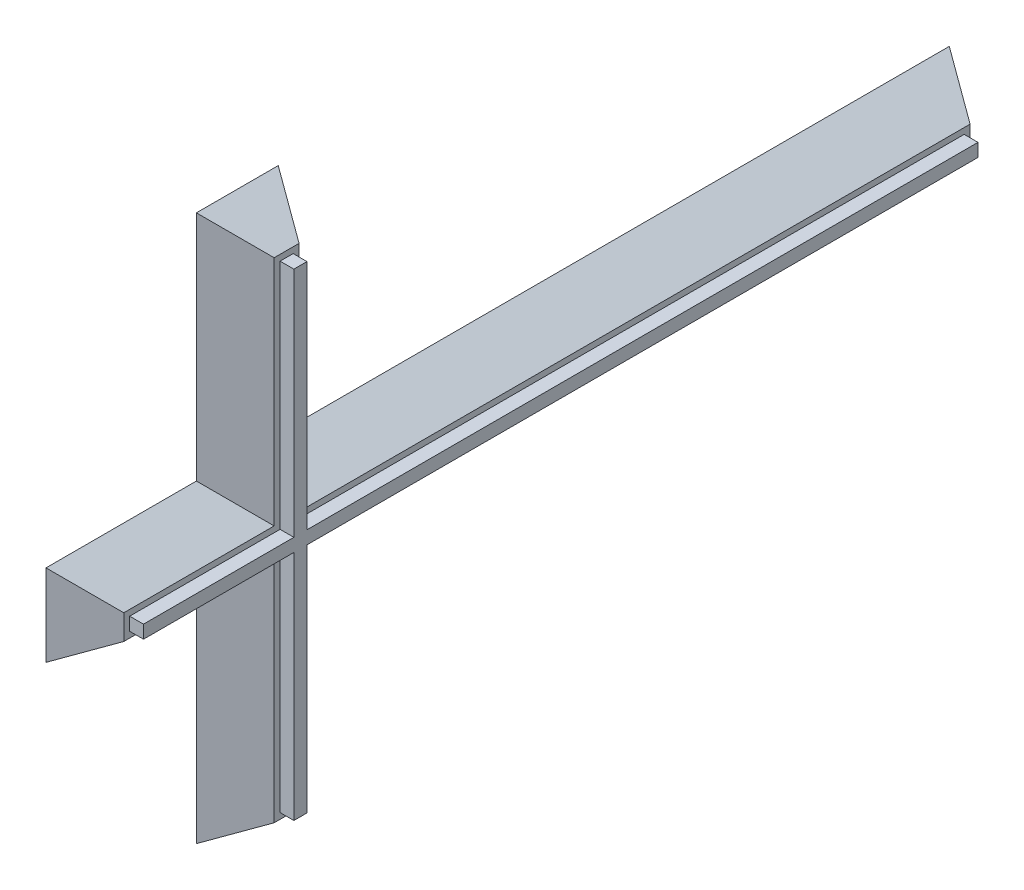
ISO-10303-21;
HEADER;
FILE_DESCRIPTION(('STEP AP214'),'2;1');
FILE_NAME('part.step','',(''),(''),'','','');
FILE_SCHEMA(('AUTOMOTIVE_DESIGN { 1 0 10303 214 1 1 1 1 }'));
ENDSEC;
DATA;
#1=APPLICATION_CONTEXT('core data for automotive mechanical design processes');
#2=APPLICATION_PROTOCOL_DEFINITION('international standard','automotive_design',2000,#1);
#3=PRODUCT_CONTEXT('',#1,'mechanical');
#4=PRODUCT('Part','Part','',(#3));
#5=PRODUCT_RELATED_PRODUCT_CATEGORY('part','',(#4));
#6=PRODUCT_DEFINITION_FORMATION('','',#4);
#7=PRODUCT_DEFINITION_CONTEXT('part definition',#1,'design');
#8=PRODUCT_DEFINITION('design','',#6,#7);
#9=PRODUCT_DEFINITION_SHAPE('','',#8);
#10=(LENGTH_UNIT() NAMED_UNIT(*) SI_UNIT(.MILLI.,.METRE.));
#11=(NAMED_UNIT(*) PLANE_ANGLE_UNIT() SI_UNIT($,.RADIAN.));
#12=(NAMED_UNIT(*) SI_UNIT($,.STERADIAN.) SOLID_ANGLE_UNIT());
#13=UNCERTAINTY_MEASURE_WITH_UNIT(LENGTH_MEASURE(1.E-05),#10,'distance_accuracy_value','');
#14=(GEOMETRIC_REPRESENTATION_CONTEXT(3) GLOBAL_UNCERTAINTY_ASSIGNED_CONTEXT((#13)) GLOBAL_UNIT_ASSIGNED_CONTEXT((#10,
#11,#12)) REPRESENTATION_CONTEXT('',''));
#15=CARTESIAN_POINT('',(0.,0.,0.));
#16=DIRECTION('',(0.,0.,1.));
#17=DIRECTION('',(1.,0.,0.));
#18=AXIS2_PLACEMENT_3D('',#15,#16,#17);
#19=CARTESIAN_POINT('',(25.,0.,0.));
#20=DIRECTION('',(-1.,0.,0.));
#21=DIRECTION('',(0.,0.,1.));
#22=AXIS2_PLACEMENT_3D('',#19,#20,#21);
#23=PLANE('',#22);
#24=DIRECTION('',(0.,-1.,0.));
#25=VECTOR('',#24,1.);
#26=CARTESIAN_POINT('',(25.,0.,-6.31624327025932));
#27=LINE('',#26,#25);
#28=CARTESIAN_POINT('',(25.,-6.31624327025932,-6.31624327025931));
#29=VERTEX_POINT('',#28);
#30=CARTESIAN_POINT('',(25.,-124.041243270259,-6.31624327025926));
#31=VERTEX_POINT('',#30);
#32=EDGE_CURVE('E284',#29,#31,#27,.T.);
#33=ORIENTED_EDGE('',*,*,#32,.F.);
#34=DIRECTION('',(0.,0.,1.));
#35=VECTOR('',#34,1.);
#36=CARTESIAN_POINT('',(25.,-6.31624327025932,0.));
#37=LINE('',#36,#35);
#38=CARTESIAN_POINT('',(25.,-6.31624327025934,-346.566243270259));
#39=VERTEX_POINT('',#38);
#40=EDGE_CURVE('E292',#39,#29,#37,.T.);
#41=ORIENTED_EDGE('',*,*,#40,.F.);
#42=DIRECTION('',(0.,-1.,0.));
#43=VECTOR('',#42,1.);
#44=CARTESIAN_POINT('',(25.,0.,-346.566243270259));
#45=LINE('',#44,#43);
#46=CARTESIAN_POINT('',(25.,6.31624327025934,-346.566243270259));
#47=VERTEX_POINT('',#46);
#48=EDGE_CURVE('E326',#47,#39,#45,.T.);
#49=ORIENTED_EDGE('',*,*,#48,.F.);
#50=DIRECTION('',(0.,0.,-1.));
#51=VECTOR('',#50,1.);
#52=CARTESIAN_POINT('',(25.,6.31624327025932,0.));
#53=LINE('',#52,#51);
#54=CARTESIAN_POINT('',(25.,6.31624327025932,-6.3162432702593));
#55=VERTEX_POINT('',#54);
#56=EDGE_CURVE('E329',#55,#47,#53,.T.);
#57=ORIENTED_EDGE('',*,*,#56,.F.);
#58=DIRECTION('',(0.,-1.,0.));
#59=VECTOR('',#58,1.);
#60=CARTESIAN_POINT('',(25.,0.,-6.3162432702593));
#61=LINE('',#60,#59);
#62=CARTESIAN_POINT('',(25.,124.091243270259,-6.31624327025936));
#63=VERTEX_POINT('',#62);
#64=EDGE_CURVE('E331',#63,#55,#61,.T.);
#65=ORIENTED_EDGE('',*,*,#64,.F.);
#66=DIRECTION('',(0.,0.,-1.));
#67=VECTOR('',#66,1.);
#68=CARTESIAN_POINT('',(25.,124.091243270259,0.));
#69=LINE('',#68,#67);
#70=CARTESIAN_POINT('',(25.,124.091243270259,6.31624327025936));
#71=VERTEX_POINT('',#70);
#72=EDGE_CURVE('E337',#71,#63,#69,.T.);
#73=ORIENTED_EDGE('',*,*,#72,.F.);
#74=DIRECTION('',(0.,1.,0.));
#75=VECTOR('',#74,1.);
#76=CARTESIAN_POINT('',(25.,0.,6.3162432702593));
#77=LINE('',#76,#75);
#78=CARTESIAN_POINT('',(25.,6.31624327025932,6.3162432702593));
#79=VERTEX_POINT('',#78);
#80=EDGE_CURVE('E345',#79,#71,#77,.T.);
#81=ORIENTED_EDGE('',*,*,#80,.F.);
#82=DIRECTION('',(0.,0.,-1.));
#83=VECTOR('',#82,1.);
#84=CARTESIAN_POINT('',(25.,6.31624327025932,0.));
#85=LINE('',#84,#83);
#86=CARTESIAN_POINT('',(25.,6.31624327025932,82.5662432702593));
#87=VERTEX_POINT('',#86);
#88=EDGE_CURVE('E347',#87,#79,#85,.T.);
#89=ORIENTED_EDGE('',*,*,#88,.F.);
#90=DIRECTION('',(0.,1.,0.));
#91=VECTOR('',#90,1.);
#92=CARTESIAN_POINT('',(25.,0.,82.5662432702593));
#93=LINE('',#92,#91);
#94=CARTESIAN_POINT('',(25.,-6.31624327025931,82.5662432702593));
#95=VERTEX_POINT('',#94);
#96=EDGE_CURVE('E348',#95,#87,#93,.T.);
#97=ORIENTED_EDGE('',*,*,#96,.F.);
#98=DIRECTION('',(0.,0.,1.));
#99=VECTOR('',#98,1.);
#100=CARTESIAN_POINT('',(25.,-6.31624327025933,0.));
#101=LINE('',#100,#99);
#102=CARTESIAN_POINT('',(25.,-6.31624327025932,6.3162432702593));
#103=VERTEX_POINT('',#102);
#104=EDGE_CURVE('E353',#103,#95,#101,.T.);
#105=ORIENTED_EDGE('',*,*,#104,.F.);
#106=DIRECTION('',(0.,1.,0.));
#107=VECTOR('',#106,1.);
#108=CARTESIAN_POINT('',(25.,0.,6.3162432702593));
#109=LINE('',#108,#107);
#110=CARTESIAN_POINT('',(25.,-124.041243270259,6.31624327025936));
#111=VERTEX_POINT('',#110);
#112=EDGE_CURVE('E360',#111,#103,#109,.T.);
#113=ORIENTED_EDGE('',*,*,#112,.F.);
#114=DIRECTION('',(0.,0.,1.));
#115=VECTOR('',#114,1.);
#116=CARTESIAN_POINT('',(25.,-124.041243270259,0.));
#117=LINE('',#116,#115);
#118=EDGE_CURVE('E47',#31,#111,#117,.T.);
#119=ORIENTED_EDGE('',*,*,#118,.F.);
#120=EDGE_LOOP('',(#33,#41,#49,#57,#65,#73,#81,#89,#97,#105,#113,#119));
#121=FACE_BOUND('',#120,.T.);
#122=DIRECTION('',(0.,0.,-1.));
#123=VECTOR('',#122,1.);
#124=CARTESIAN_POINT('',(25.,-121.041243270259,3.31624327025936));
#125=LINE('',#124,#123);
#126=CARTESIAN_POINT('',(25.,-121.041243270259,3.31624327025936));
#127=VERTEX_POINT('',#126);
#128=CARTESIAN_POINT('',(25.,-121.041243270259,-3.31624327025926));
#129=VERTEX_POINT('',#128);
#130=EDGE_CURVE('E62',#127,#129,#125,.T.);
#131=ORIENTED_EDGE('',*,*,#130,.F.);
#132=DIRECTION('',(0.,-1.,0.));
#133=VECTOR('',#132,1.);
#134=CARTESIAN_POINT('',(25.,-3.31624327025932,3.3162432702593));
#135=LINE('',#134,#133);
#136=CARTESIAN_POINT('',(25.,-3.31624327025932,3.3162432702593));
#137=VERTEX_POINT('',#136);
#138=EDGE_CURVE('E70',#137,#127,#135,.T.);
#139=ORIENTED_EDGE('',*,*,#138,.F.);
#140=DIRECTION('',(0.,0.,-1.));
#141=VECTOR('',#140,1.);
#142=CARTESIAN_POINT('',(25.,-3.31624327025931,79.5662432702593));
#143=LINE('',#142,#141);
#144=CARTESIAN_POINT('',(25.,-3.31624327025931,79.5662432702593));
#145=VERTEX_POINT('',#144);
#146=EDGE_CURVE('E623',#145,#137,#143,.T.);
#147=ORIENTED_EDGE('',*,*,#146,.F.);
#148=DIRECTION('',(0.,-1.,0.));
#149=VECTOR('',#148,1.);
#150=CARTESIAN_POINT('',(25.,3.31624327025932,79.5662432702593));
#151=LINE('',#150,#149);
#152=CARTESIAN_POINT('',(25.,3.31624327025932,79.5662432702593));
#153=VERTEX_POINT('',#152);
#154=EDGE_CURVE('E704',#153,#145,#151,.T.);
#155=ORIENTED_EDGE('',*,*,#154,.F.);
#156=DIRECTION('',(0.,0.,1.));
#157=VECTOR('',#156,1.);
#158=CARTESIAN_POINT('',(25.,3.31624327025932,3.3162432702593));
#159=LINE('',#158,#157);
#160=CARTESIAN_POINT('',(25.,3.31624327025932,3.3162432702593));
#161=VERTEX_POINT('',#160);
#162=EDGE_CURVE('E701',#161,#153,#159,.T.);
#163=ORIENTED_EDGE('',*,*,#162,.F.);
#164=DIRECTION('',(0.,-1.,0.));
#165=VECTOR('',#164,1.);
#166=CARTESIAN_POINT('',(25.,121.091243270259,3.31624327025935));
#167=LINE('',#166,#165);
#168=CARTESIAN_POINT('',(25.,121.091243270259,3.31624327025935));
#169=VERTEX_POINT('',#168);
#170=EDGE_CURVE('E700',#169,#161,#167,.T.);
#171=ORIENTED_EDGE('',*,*,#170,.F.);
#172=DIRECTION('',(0.,0.,1.));
#173=VECTOR('',#172,1.);
#174=CARTESIAN_POINT('',(25.,121.091243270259,-3.31624327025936));
#175=LINE('',#174,#173);
#176=CARTESIAN_POINT('',(25.,121.091243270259,-3.31624327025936));
#177=VERTEX_POINT('',#176);
#178=EDGE_CURVE('E691',#177,#169,#175,.T.);
#179=ORIENTED_EDGE('',*,*,#178,.F.);
#180=DIRECTION('',(0.,1.,0.));
#181=VECTOR('',#180,1.);
#182=CARTESIAN_POINT('',(25.,3.31624327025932,-3.3162432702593));
#183=LINE('',#182,#181);
#184=CARTESIAN_POINT('',(25.,3.31624327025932,-3.3162432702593));
#185=VERTEX_POINT('',#184);
#186=EDGE_CURVE('E689',#185,#177,#183,.T.);
#187=ORIENTED_EDGE('',*,*,#186,.F.);
#188=DIRECTION('',(0.,0.,1.));
#189=VECTOR('',#188,1.);
#190=CARTESIAN_POINT('',(25.,3.31624327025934,-343.566243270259));
#191=LINE('',#190,#189);
#192=CARTESIAN_POINT('',(25.,3.31624327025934,-343.566243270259));
#193=VERTEX_POINT('',#192);
#194=EDGE_CURVE('E681',#193,#185,#191,.T.);
#195=ORIENTED_EDGE('',*,*,#194,.F.);
#196=DIRECTION('',(0.,1.,0.));
#197=VECTOR('',#196,1.);
#198=CARTESIAN_POINT('',(25.,-3.31624327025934,-343.566243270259));
#199=LINE('',#198,#197);
#200=CARTESIAN_POINT('',(25.,-3.31624327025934,-343.566243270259));
#201=VERTEX_POINT('',#200);
#202=EDGE_CURVE('E673',#201,#193,#199,.T.);
#203=ORIENTED_EDGE('',*,*,#202,.F.);
#204=DIRECTION('',(0.,0.,-1.));
#205=VECTOR('',#204,1.);
#206=CARTESIAN_POINT('',(25.,-3.31624327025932,-3.31624327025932));
#207=LINE('',#206,#205);
#208=CARTESIAN_POINT('',(25.,-3.31624327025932,-3.31624327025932));
#209=VERTEX_POINT('',#208);
#210=EDGE_CURVE('E674',#209,#201,#207,.T.);
#211=ORIENTED_EDGE('',*,*,#210,.F.);
#212=DIRECTION('',(0.,1.,0.));
#213=VECTOR('',#212,1.);
#214=CARTESIAN_POINT('',(25.,-121.041243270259,-3.31624327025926));
#215=LINE('',#214,#213);
#216=EDGE_CURVE('E677',#129,#209,#215,.T.);
#217=ORIENTED_EDGE('',*,*,#216,.F.);
#218=EDGE_LOOP('',(#131,#139,#147,#155,#163,#171,#179,#187,#195,#203,#211,#217));
#219=FACE_BOUND('',#218,.T.);
#220=ADVANCED_FACE('F44',(#121,#219),#23,.F.);
#221=CARTESIAN_POINT('',(0.,-20.75,-20.75));
#222=DIRECTION('',(0.500000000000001,0.,-0.866025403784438));
#223=DIRECTION('',(0.866025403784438,0.,0.500000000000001));
#224=AXIS2_PLACEMENT_3D('',#221,#222,#223);
#225=PLANE('',#224);
#226=DIRECTION('',(0.,-1.,0.));
#227=VECTOR('',#226,1.);
#228=CARTESIAN_POINT('',(0.,-20.75,-20.75));
#229=LINE('',#228,#227);
#230=CARTESIAN_POINT('',(0.,-20.75,-20.75));
#231=VERTEX_POINT('',#230);
#232=CARTESIAN_POINT('',(0.,-138.475,-20.7499999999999));
#233=VERTEX_POINT('',#232);
#234=EDGE_CURVE('E233',#231,#233,#229,.T.);
#235=ORIENTED_EDGE('',*,*,#234,.F.);
#236=DIRECTION('',(-0.774596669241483,-0.447213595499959,-0.447213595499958));
#237=VECTOR('',#236,1.);
#238=CARTESIAN_POINT('',(0.,-20.75,-20.75));
#239=LINE('',#238,#237);
#240=EDGE_CURVE('E11',#29,#231,#239,.T.);
#241=ORIENTED_EDGE('',*,*,#240,.F.);
#242=ORIENTED_EDGE('',*,*,#32,.T.);
#243=DIRECTION('',(-0.774596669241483,-0.447213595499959,-0.447213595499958));
#244=VECTOR('',#243,1.);
#245=CARTESIAN_POINT('',(40.7811362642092,-114.93,2.7950000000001));
#246=LINE('',#245,#244);
#247=EDGE_CURVE('E290',#31,#233,#246,.T.);
#248=ORIENTED_EDGE('',*,*,#247,.T.);
#249=EDGE_LOOP('',(#235,#241,#242,#248));
#250=FACE_BOUND('',#249,.T.);
#251=ADVANCED_FACE('F380',(#250),#225,.T.);
#252=CARTESIAN_POINT('',(0.,-20.75,-361.));
#253=DIRECTION('',(0.500000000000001,-0.866025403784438,0.));
#254=DIRECTION('',(0.866025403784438,0.500000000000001,0.));
#255=AXIS2_PLACEMENT_3D('',#252,#253,#254);
#256=PLANE('',#255);
#257=DIRECTION('',(0.,0.,1.));
#258=VECTOR('',#257,1.);
#259=CARTESIAN_POINT('',(0.,-20.75,-361.));
#260=LINE('',#259,#258);
#261=CARTESIAN_POINT('',(0.,-20.75,-361.));
#262=VERTEX_POINT('',#261);
#263=EDGE_CURVE('E285',#262,#231,#260,.T.);
#264=ORIENTED_EDGE('',*,*,#263,.F.);
#265=DIRECTION('',(-0.774596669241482,-0.447213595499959,-0.447213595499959));
#266=VECTOR('',#265,1.);
#267=CARTESIAN_POINT('',(14.3760217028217,-12.45,-352.7));
#268=LINE('',#267,#266);
#269=EDGE_CURVE('E54',#39,#262,#268,.T.);
#270=ORIENTED_EDGE('',*,*,#269,.F.);
#271=ORIENTED_EDGE('',*,*,#40,.T.);
#272=ORIENTED_EDGE('',*,*,#240,.T.);
#273=EDGE_LOOP('',(#264,#270,#271,#272));
#274=FACE_BOUND('',#273,.T.);
#275=ADVANCED_FACE('F50',(#274),#256,.T.);
#276=CARTESIAN_POINT('',(0.,20.75,-361.));
#277=DIRECTION('',(0.500000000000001,0.,-0.866025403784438));
#278=DIRECTION('',(0.866025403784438,0.,0.500000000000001));
#279=AXIS2_PLACEMENT_3D('',#276,#277,#278);
#280=PLANE('',#279);
#281=DIRECTION('',(0.,-1.,0.));
#282=VECTOR('',#281,1.);
#283=CARTESIAN_POINT('',(0.,20.75,-361.));
#284=LINE('',#283,#282);
#285=CARTESIAN_POINT('',(0.,20.75,-361.));
#286=VERTEX_POINT('',#285);
#287=EDGE_CURVE('E279',#286,#262,#284,.T.);
#288=ORIENTED_EDGE('',*,*,#287,.F.);
#289=DIRECTION('',(-0.774596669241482,0.447213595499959,-0.447213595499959));
#290=VECTOR('',#289,1.);
#291=CARTESIAN_POINT('',(117.866057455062,-47.3000000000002,-292.95));
#292=LINE('',#291,#290);
#293=EDGE_CURVE('E312',#47,#286,#292,.T.);
#294=ORIENTED_EDGE('',*,*,#293,.F.);
#295=ORIENTED_EDGE('',*,*,#48,.T.);
#296=ORIENTED_EDGE('',*,*,#269,.T.);
#297=EDGE_LOOP('',(#288,#294,#295,#296));
#298=FACE_BOUND('',#297,.T.);
#299=ADVANCED_FACE('F411',(#298),#280,.T.);
#300=CARTESIAN_POINT('',(0.,20.75,-20.75));
#301=DIRECTION('',(0.500000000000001,0.866025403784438,0.));
#302=DIRECTION('',(0.866025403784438,-0.500000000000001,0.));
#303=AXIS2_PLACEMENT_3D('',#300,#301,#302);
#304=PLANE('',#303);
#305=DIRECTION('',(0.,0.,-1.));
#306=VECTOR('',#305,1.);
#307=CARTESIAN_POINT('',(0.,20.75,-20.75));
#308=LINE('',#307,#306);
#309=CARTESIAN_POINT('',(0.,20.75,-20.75));
#310=VERTEX_POINT('',#309);
#311=EDGE_CURVE('E273',#310,#286,#308,.T.);
#312=ORIENTED_EDGE('',*,*,#311,.F.);
#313=DIRECTION('',(-0.774596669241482,0.447213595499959,-0.447213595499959));
#314=VECTOR('',#313,1.);
#315=CARTESIAN_POINT('',(0.,20.75,-20.75));
#316=LINE('',#315,#314);
#317=EDGE_CURVE('E315',#55,#310,#316,.T.);
#318=ORIENTED_EDGE('',*,*,#317,.F.);
#319=ORIENTED_EDGE('',*,*,#56,.T.);
#320=ORIENTED_EDGE('',*,*,#293,.T.);
#321=EDGE_LOOP('',(#312,#318,#319,#320));
#322=FACE_BOUND('',#321,.T.);
#323=ADVANCED_FACE('F387',(#322),#304,.T.);
#324=CARTESIAN_POINT('',(0.,138.525,-20.75));
#325=DIRECTION('',(0.500000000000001,0.,-0.866025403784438));
#326=DIRECTION('',(0.866025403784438,0.,0.500000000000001));
#327=AXIS2_PLACEMENT_3D('',#324,#325,#326);
#328=PLANE('',#327);
#329=DIRECTION('',(0.,-1.,0.));
#330=VECTOR('',#329,1.);
#331=CARTESIAN_POINT('',(0.,138.525,-20.75));
#332=LINE('',#331,#330);
#333=CARTESIAN_POINT('',(0.,138.525,-20.75));
#334=VERTEX_POINT('',#333);
#335=EDGE_CURVE('E269',#334,#310,#332,.T.);
#336=ORIENTED_EDGE('',*,*,#335,.F.);
#337=DIRECTION('',(-0.774596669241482,0.447213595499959,-0.447213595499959));
#338=VECTOR('',#337,1.);
#339=CARTESIAN_POINT('',(14.3760217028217,130.225,-12.45));
#340=LINE('',#339,#338);
#341=EDGE_CURVE('E310',#63,#334,#340,.T.);
#342=ORIENTED_EDGE('',*,*,#341,.F.);
#343=ORIENTED_EDGE('',*,*,#64,.T.);
#344=ORIENTED_EDGE('',*,*,#317,.T.);
#345=EDGE_LOOP('',(#336,#342,#343,#344));
#346=FACE_BOUND('',#345,.T.);
#347=ADVANCED_FACE('F388',(#346),#328,.T.);
#348=CARTESIAN_POINT('',(0.,138.525,20.75));
#349=DIRECTION('',(0.500000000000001,0.866025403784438,0.));
#350=DIRECTION('',(0.866025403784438,-0.500000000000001,0.));
#351=AXIS2_PLACEMENT_3D('',#348,#349,#350);
#352=PLANE('',#351);
#353=DIRECTION('',(0.,0.,-1.));
#354=VECTOR('',#353,1.);
#355=CARTESIAN_POINT('',(0.,138.525,20.75));
#356=LINE('',#355,#354);
#357=CARTESIAN_POINT('',(0.,138.525,20.75));
#358=VERTEX_POINT('',#357);
#359=EDGE_CURVE('E266',#358,#334,#356,.T.);
#360=ORIENTED_EDGE('',*,*,#359,.F.);
#361=DIRECTION('',(-0.774596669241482,0.447213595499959,0.447213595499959));
#362=VECTOR('',#361,1.);
#363=CARTESIAN_POINT('',(40.798456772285,114.97,-2.80500000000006));
#364=LINE('',#363,#362);
#365=EDGE_CURVE('E308',#71,#358,#364,.T.);
#366=ORIENTED_EDGE('',*,*,#365,.F.);
#367=ORIENTED_EDGE('',*,*,#72,.T.);
#368=ORIENTED_EDGE('',*,*,#341,.T.);
#369=EDGE_LOOP('',(#360,#366,#367,#368));
#370=FACE_BOUND('',#369,.T.);
#371=ADVANCED_FACE('F394',(#370),#352,.T.);
#372=CARTESIAN_POINT('',(0.,20.75,20.75));
#373=DIRECTION('',(0.500000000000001,0.,0.866025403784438));
#374=DIRECTION('',(0.866025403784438,0.,-0.500000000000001));
#375=AXIS2_PLACEMENT_3D('',#372,#373,#374);
#376=PLANE('',#375);
#377=DIRECTION('',(0.,1.,0.));
#378=VECTOR('',#377,1.);
#379=CARTESIAN_POINT('',(0.,20.75,20.75));
#380=LINE('',#379,#378);
#381=CARTESIAN_POINT('',(0.,20.75,20.75));
#382=VERTEX_POINT('',#381);
#383=EDGE_CURVE('E265',#382,#358,#380,.T.);
#384=ORIENTED_EDGE('',*,*,#383,.F.);
#385=DIRECTION('',(-0.774596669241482,0.447213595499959,0.447213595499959));
#386=VECTOR('',#385,1.);
#387=CARTESIAN_POINT('',(0.,20.75,20.75));
#388=LINE('',#387,#386);
#389=EDGE_CURVE('E301',#79,#382,#388,.T.);
#390=ORIENTED_EDGE('',*,*,#389,.F.);
#391=ORIENTED_EDGE('',*,*,#80,.T.);
#392=ORIENTED_EDGE('',*,*,#365,.T.);
#393=EDGE_LOOP('',(#384,#390,#391,#392));
#394=FACE_BOUND('',#393,.T.);
#395=ADVANCED_FACE('F396',(#394),#376,.T.);
#396=CARTESIAN_POINT('',(0.,20.75,97.));
#397=DIRECTION('',(0.500000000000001,0.866025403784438,0.));
#398=DIRECTION('',(0.866025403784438,-0.500000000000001,0.));
#399=AXIS2_PLACEMENT_3D('',#396,#397,#398);
#400=PLANE('',#399);
#401=DIRECTION('',(0.,0.,-1.));
#402=VECTOR('',#401,1.);
#403=CARTESIAN_POINT('',(0.,20.75,97.));
#404=LINE('',#403,#402);
#405=CARTESIAN_POINT('',(0.,20.75,97.));
#406=VERTEX_POINT('',#405);
#407=EDGE_CURVE('E256',#406,#382,#404,.T.);
#408=ORIENTED_EDGE('',*,*,#407,.F.);
#409=DIRECTION('',(-0.774596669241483,0.447213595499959,0.447213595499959));
#410=VECTOR('',#409,1.);
#411=CARTESIAN_POINT('',(14.3760217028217,12.45,88.7));
#412=LINE('',#411,#410);
#413=EDGE_CURVE('E299',#87,#406,#412,.T.);
#414=ORIENTED_EDGE('',*,*,#413,.F.);
#415=ORIENTED_EDGE('',*,*,#88,.T.);
#416=ORIENTED_EDGE('',*,*,#389,.T.);
#417=EDGE_LOOP('',(#408,#414,#415,#416));
#418=FACE_BOUND('',#417,.T.);
#419=ADVANCED_FACE('F401',(#418),#400,.T.);
#420=CARTESIAN_POINT('',(0.,-20.75,97.));
#421=DIRECTION('',(0.500000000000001,0.,0.866025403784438));
#422=DIRECTION('',(0.866025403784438,0.,-0.500000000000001));
#423=AXIS2_PLACEMENT_3D('',#420,#421,#422);
#424=PLANE('',#423);
#425=DIRECTION('',(0.,1.,0.));
#426=VECTOR('',#425,1.);
#427=CARTESIAN_POINT('',(0.,-20.75,97.));
#428=LINE('',#427,#426);
#429=CARTESIAN_POINT('',(0.,-20.75,97.));
#430=VERTEX_POINT('',#429);
#431=EDGE_CURVE('E255',#430,#406,#428,.T.);
#432=ORIENTED_EDGE('',*,*,#431,.F.);
#433=DIRECTION('',(-0.774596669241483,-0.447213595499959,0.447213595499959));
#434=VECTOR('',#433,1.);
#435=CARTESIAN_POINT('',(26.4137748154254,-5.49999999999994,81.75));
#436=LINE('',#435,#434);
#437=EDGE_CURVE('E300',#95,#430,#436,.T.);
#438=ORIENTED_EDGE('',*,*,#437,.F.);
#439=ORIENTED_EDGE('',*,*,#96,.T.);
#440=ORIENTED_EDGE('',*,*,#413,.T.);
#441=EDGE_LOOP('',(#432,#438,#439,#440));
#442=FACE_BOUND('',#441,.T.);
#443=ADVANCED_FACE('F406',(#442),#424,.T.);
#444=CARTESIAN_POINT('',(0.,-20.75,20.75));
#445=DIRECTION('',(0.500000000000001,-0.866025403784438,0.));
#446=DIRECTION('',(0.866025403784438,0.500000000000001,0.));
#447=AXIS2_PLACEMENT_3D('',#444,#445,#446);
#448=PLANE('',#447);
#449=DIRECTION('',(0.,0.,1.));
#450=VECTOR('',#449,1.);
#451=CARTESIAN_POINT('',(0.,-20.75,20.75));
#452=LINE('',#451,#450);
#453=CARTESIAN_POINT('',(0.,-20.75,20.75));
#454=VERTEX_POINT('',#453);
#455=EDGE_CURVE('E247',#454,#430,#452,.T.);
#456=ORIENTED_EDGE('',*,*,#455,.F.);
#457=DIRECTION('',(-0.774596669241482,-0.447213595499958,0.447213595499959));
#458=VECTOR('',#457,1.);
#459=CARTESIAN_POINT('',(0.,-20.75,20.75));
#460=LINE('',#459,#458);
#461=EDGE_CURVE('E294',#103,#454,#460,.T.);
#462=ORIENTED_EDGE('',*,*,#461,.F.);
#463=ORIENTED_EDGE('',*,*,#104,.T.);
#464=ORIENTED_EDGE('',*,*,#437,.T.);
#465=EDGE_LOOP('',(#456,#462,#463,#464));
#466=FACE_BOUND('',#465,.T.);
#467=ADVANCED_FACE('F408',(#466),#448,.T.);
#468=CARTESIAN_POINT('',(0.,-138.475,20.75));
#469=DIRECTION('',(0.500000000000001,0.,0.866025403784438));
#470=DIRECTION('',(0.866025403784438,0.,-0.500000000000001));
#471=AXIS2_PLACEMENT_3D('',#468,#469,#470);
#472=PLANE('',#471);
#473=DIRECTION('',(0.,1.,0.));
#474=VECTOR('',#473,1.);
#475=CARTESIAN_POINT('',(0.,-138.475,20.75));
#476=LINE('',#475,#474);
#477=CARTESIAN_POINT('',(0.,-138.475,20.75));
#478=VERTEX_POINT('',#477);
#479=EDGE_CURVE('E248',#478,#454,#476,.T.);
#480=ORIENTED_EDGE('',*,*,#479,.F.);
#481=DIRECTION('',(-0.774596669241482,-0.447213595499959,0.447213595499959));
#482=VECTOR('',#481,1.);
#483=CARTESIAN_POINT('',(14.3760217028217,-130.175,12.45));
#484=LINE('',#483,#482);
#485=EDGE_CURVE('E287',#111,#478,#484,.T.);
#486=ORIENTED_EDGE('',*,*,#485,.F.);
#487=ORIENTED_EDGE('',*,*,#112,.T.);
#488=ORIENTED_EDGE('',*,*,#461,.T.);
#489=EDGE_LOOP('',(#480,#486,#487,#488));
#490=FACE_BOUND('',#489,.T.);
#491=ADVANCED_FACE('F409',(#490),#472,.T.);
#492=CARTESIAN_POINT('',(0.,-138.475,-20.7499999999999));
#493=DIRECTION('',(0.500000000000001,-0.866025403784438,0.));
#494=DIRECTION('',(0.866025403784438,0.500000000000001,0.));
#495=AXIS2_PLACEMENT_3D('',#492,#493,#494);
#496=PLANE('',#495);
#497=DIRECTION('',(0.,0.,1.));
#498=VECTOR('',#497,1.);
#499=CARTESIAN_POINT('',(0.,-138.475,-20.7499999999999));
#500=LINE('',#499,#498);
#501=EDGE_CURVE('E240',#233,#478,#500,.T.);
#502=ORIENTED_EDGE('',*,*,#501,.F.);
#503=ORIENTED_EDGE('',*,*,#247,.F.);
#504=ORIENTED_EDGE('',*,*,#118,.T.);
#505=ORIENTED_EDGE('',*,*,#485,.T.);
#506=EDGE_LOOP('',(#502,#503,#504,#505));
#507=FACE_BOUND('',#506,.T.);
#508=ADVANCED_FACE('F369',(#507),#496,.T.);
#509=CARTESIAN_POINT('',(0.,0.,0.));
#510=DIRECTION('',(-1.,0.,0.));
#511=DIRECTION('',(0.,0.,1.));
#512=AXIS2_PLACEMENT_3D('',#509,#510,#511);
#513=PLANE('',#512);
#514=ORIENTED_EDGE('',*,*,#234,.T.);
#515=ORIENTED_EDGE('',*,*,#501,.T.);
#516=ORIENTED_EDGE('',*,*,#479,.T.);
#517=ORIENTED_EDGE('',*,*,#455,.T.);
#518=ORIENTED_EDGE('',*,*,#431,.T.);
#519=ORIENTED_EDGE('',*,*,#407,.T.);
#520=ORIENTED_EDGE('',*,*,#383,.T.);
#521=ORIENTED_EDGE('',*,*,#359,.T.);
#522=ORIENTED_EDGE('',*,*,#335,.T.);
#523=ORIENTED_EDGE('',*,*,#311,.T.);
#524=ORIENTED_EDGE('',*,*,#287,.T.);
#525=ORIENTED_EDGE('',*,*,#263,.T.);
#526=EDGE_LOOP('',(#514,#515,#516,#517,#518,#519,#520,#521,#522,#523,#524,#525));
#527=FACE_BOUND('',#526,.T.);
#528=ADVANCED_FACE('F415',(#527),#513,.T.);
#529=CARTESIAN_POINT('',(32.,-121.041243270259,3.31624327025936));
#530=DIRECTION('',(0.,1.,0.));
#531=DIRECTION('',(0.,0.,1.));
#532=AXIS2_PLACEMENT_3D('',#529,#530,#531);
#533=PLANE('',#532);
#534=ORIENTED_EDGE('',*,*,#130,.T.);
#535=DIRECTION('',(-1.,0.,0.));
#536=VECTOR('',#535,1.);
#537=CARTESIAN_POINT('',(32.,-121.041243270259,-3.31624327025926));
#538=LINE('',#537,#536);
#539=CARTESIAN_POINT('',(32.,-121.041243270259,-3.31624327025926));
#540=VERTEX_POINT('',#539);
#541=EDGE_CURVE('E211',#540,#129,#538,.T.);
#542=ORIENTED_EDGE('',*,*,#541,.F.);
#543=DIRECTION('',(0.,0.,-1.));
#544=VECTOR('',#543,1.);
#545=CARTESIAN_POINT('',(32.,-121.041243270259,3.31624327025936));
#546=LINE('',#545,#544);
#547=CARTESIAN_POINT('',(32.,-121.041243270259,3.31624327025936));
#548=VERTEX_POINT('',#547);
#549=EDGE_CURVE('E217',#548,#540,#546,.T.);
#550=ORIENTED_EDGE('',*,*,#549,.F.);
#551=DIRECTION('',(-1.,0.,0.));
#552=VECTOR('',#551,1.);
#553=CARTESIAN_POINT('',(32.,-121.041243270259,3.31624327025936));
#554=LINE('',#553,#552);
#555=EDGE_CURVE('E622',#548,#127,#554,.T.);
#556=ORIENTED_EDGE('',*,*,#555,.T.);
#557=EDGE_LOOP('',(#534,#542,#550,#556));
#558=FACE_BOUND('',#557,.T.);
#559=ADVANCED_FACE('F228',(#558),#533,.F.);
#560=CARTESIAN_POINT('',(32.,-121.041243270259,-3.31624327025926));
#561=DIRECTION('',(0.,0.,1.));
#562=DIRECTION('',(0.,-1.,0.));
#563=AXIS2_PLACEMENT_3D('',#560,#561,#562);
#564=PLANE('',#563);
#565=ORIENTED_EDGE('',*,*,#216,.T.);
#566=DIRECTION('',(-1.,0.,0.));
#567=VECTOR('',#566,1.);
#568=CARTESIAN_POINT('',(32.,-3.31624327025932,-3.31624327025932));
#569=LINE('',#568,#567);
#570=CARTESIAN_POINT('',(32.,-3.31624327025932,-3.31624327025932));
#571=VERTEX_POINT('',#570);
#572=EDGE_CURVE('E213',#571,#209,#569,.T.);
#573=ORIENTED_EDGE('',*,*,#572,.F.);
#574=DIRECTION('',(0.,1.,0.));
#575=VECTOR('',#574,1.);
#576=CARTESIAN_POINT('',(32.,-121.041243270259,-3.31624327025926));
#577=LINE('',#576,#575);
#578=EDGE_CURVE('E206',#540,#571,#577,.T.);
#579=ORIENTED_EDGE('',*,*,#578,.F.);
#580=ORIENTED_EDGE('',*,*,#541,.T.);
#581=EDGE_LOOP('',(#565,#573,#579,#580));
#582=FACE_BOUND('',#581,.T.);
#583=ADVANCED_FACE('F207',(#582),#564,.F.);
#584=CARTESIAN_POINT('',(32.,-3.31624327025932,-3.31624327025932));
#585=DIRECTION('',(0.,1.,0.));
#586=DIRECTION('',(0.,0.,1.));
#587=AXIS2_PLACEMENT_3D('',#584,#585,#586);
#588=PLANE('',#587);
#589=ORIENTED_EDGE('',*,*,#210,.T.);
#590=DIRECTION('',(-1.,0.,0.));
#591=VECTOR('',#590,1.);
#592=CARTESIAN_POINT('',(32.,-3.31624327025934,-343.566243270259));
#593=LINE('',#592,#591);
#594=CARTESIAN_POINT('',(32.,-3.31624327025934,-343.566243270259));
#595=VERTEX_POINT('',#594);
#596=EDGE_CURVE('E239',#595,#201,#593,.T.);
#597=ORIENTED_EDGE('',*,*,#596,.F.);
#598=DIRECTION('',(0.,0.,-1.));
#599=VECTOR('',#598,1.);
#600=CARTESIAN_POINT('',(32.,-3.31624327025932,-3.31624327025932));
#601=LINE('',#600,#599);
#602=EDGE_CURVE('E220',#571,#595,#601,.T.);
#603=ORIENTED_EDGE('',*,*,#602,.F.);
#604=ORIENTED_EDGE('',*,*,#572,.T.);
#605=EDGE_LOOP('',(#589,#597,#603,#604));
#606=FACE_BOUND('',#605,.T.);
#607=ADVANCED_FACE('F512',(#606),#588,.F.);
#608=CARTESIAN_POINT('',(32.,-3.31624327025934,-343.566243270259));
#609=DIRECTION('',(0.,0.,1.));
#610=DIRECTION('',(1.,0.,0.));
#611=AXIS2_PLACEMENT_3D('',#608,#609,#610);
#612=PLANE('',#611);
#613=ORIENTED_EDGE('',*,*,#202,.T.);
#614=DIRECTION('',(-1.,0.,0.));
#615=VECTOR('',#614,1.);
#616=CARTESIAN_POINT('',(32.,3.31624327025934,-343.566243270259));
#617=LINE('',#616,#615);
#618=CARTESIAN_POINT('',(32.,3.31624327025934,-343.566243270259));
#619=VERTEX_POINT('',#618);
#620=EDGE_CURVE('E662',#619,#193,#617,.T.);
#621=ORIENTED_EDGE('',*,*,#620,.F.);
#622=DIRECTION('',(0.,1.,0.));
#623=VECTOR('',#622,1.);
#624=CARTESIAN_POINT('',(32.,-3.31624327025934,-343.566243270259));
#625=LINE('',#624,#623);
#626=EDGE_CURVE('E675',#595,#619,#625,.T.);
#627=ORIENTED_EDGE('',*,*,#626,.F.);
#628=ORIENTED_EDGE('',*,*,#596,.T.);
#629=EDGE_LOOP('',(#613,#621,#627,#628));
#630=FACE_BOUND('',#629,.T.);
#631=ADVANCED_FACE('F518',(#630),#612,.F.);
#632=CARTESIAN_POINT('',(32.,3.31624327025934,-343.566243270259));
#633=DIRECTION('',(0.,-1.,0.));
#634=DIRECTION('',(0.,0.,-1.));
#635=AXIS2_PLACEMENT_3D('',#632,#633,#634);
#636=PLANE('',#635);
#637=ORIENTED_EDGE('',*,*,#194,.T.);
#638=DIRECTION('',(-1.,0.,0.));
#639=VECTOR('',#638,1.);
#640=CARTESIAN_POINT('',(32.,3.31624327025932,-3.3162432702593));
#641=LINE('',#640,#639);
#642=CARTESIAN_POINT('',(32.,3.31624327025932,-3.3162432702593));
#643=VERTEX_POINT('',#642);
#644=EDGE_CURVE('E660',#643,#185,#641,.T.);
#645=ORIENTED_EDGE('',*,*,#644,.F.);
#646=DIRECTION('',(0.,0.,1.));
#647=VECTOR('',#646,1.);
#648=CARTESIAN_POINT('',(32.,3.31624327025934,-343.566243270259));
#649=LINE('',#648,#647);
#650=EDGE_CURVE('E726',#619,#643,#649,.T.);
#651=ORIENTED_EDGE('',*,*,#650,.F.);
#652=ORIENTED_EDGE('',*,*,#620,.T.);
#653=EDGE_LOOP('',(#637,#645,#651,#652));
#654=FACE_BOUND('',#653,.T.);
#655=ADVANCED_FACE('F530',(#654),#636,.F.);
#656=CARTESIAN_POINT('',(32.,3.31624327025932,-3.3162432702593));
#657=DIRECTION('',(0.,0.,1.));
#658=DIRECTION('',(0.,-1.,0.));
#659=AXIS2_PLACEMENT_3D('',#656,#657,#658);
#660=PLANE('',#659);
#661=ORIENTED_EDGE('',*,*,#186,.T.);
#662=DIRECTION('',(-1.,0.,0.));
#663=VECTOR('',#662,1.);
#664=CARTESIAN_POINT('',(32.,121.091243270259,-3.31624327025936));
#665=LINE('',#664,#663);
#666=CARTESIAN_POINT('',(32.,121.091243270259,-3.31624327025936));
#667=VERTEX_POINT('',#666);
#668=EDGE_CURVE('E653',#667,#177,#665,.T.);
#669=ORIENTED_EDGE('',*,*,#668,.F.);
#670=DIRECTION('',(0.,1.,0.));
#671=VECTOR('',#670,1.);
#672=CARTESIAN_POINT('',(32.,3.31624327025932,-3.3162432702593));
#673=LINE('',#672,#671);
#674=EDGE_CURVE('E728',#643,#667,#673,.T.);
#675=ORIENTED_EDGE('',*,*,#674,.F.);
#676=ORIENTED_EDGE('',*,*,#644,.T.);
#677=EDGE_LOOP('',(#661,#669,#675,#676));
#678=FACE_BOUND('',#677,.T.);
#679=ADVANCED_FACE('F537',(#678),#660,.F.);
#680=CARTESIAN_POINT('',(32.,121.091243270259,-3.31624327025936));
#681=DIRECTION('',(0.,-1.,0.));
#682=DIRECTION('',(0.,0.,-1.));
#683=AXIS2_PLACEMENT_3D('',#680,#681,#682);
#684=PLANE('',#683);
#685=ORIENTED_EDGE('',*,*,#178,.T.);
#686=DIRECTION('',(-1.,0.,0.));
#687=VECTOR('',#686,1.);
#688=CARTESIAN_POINT('',(32.,121.091243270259,3.31624327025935));
#689=LINE('',#688,#687);
#690=CARTESIAN_POINT('',(32.,121.091243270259,3.31624327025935));
#691=VERTEX_POINT('',#690);
#692=EDGE_CURVE('E647',#691,#169,#689,.T.);
#693=ORIENTED_EDGE('',*,*,#692,.F.);
#694=DIRECTION('',(0.,0.,1.));
#695=VECTOR('',#694,1.);
#696=CARTESIAN_POINT('',(32.,121.091243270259,-3.31624327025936));
#697=LINE('',#696,#695);
#698=EDGE_CURVE('E725',#667,#691,#697,.T.);
#699=ORIENTED_EDGE('',*,*,#698,.F.);
#700=ORIENTED_EDGE('',*,*,#668,.T.);
#701=EDGE_LOOP('',(#685,#693,#699,#700));
#702=FACE_BOUND('',#701,.T.);
#703=ADVANCED_FACE('F548',(#702),#684,.F.);
#704=CARTESIAN_POINT('',(32.,121.091243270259,3.31624327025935));
#705=DIRECTION('',(0.,0.,-1.));
#706=DIRECTION('',(0.,1.,0.));
#707=AXIS2_PLACEMENT_3D('',#704,#705,#706);
#708=PLANE('',#707);
#709=ORIENTED_EDGE('',*,*,#170,.T.);
#710=DIRECTION('',(-1.,0.,0.));
#711=VECTOR('',#710,1.);
#712=CARTESIAN_POINT('',(32.,3.31624327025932,3.3162432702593));
#713=LINE('',#712,#711);
#714=CARTESIAN_POINT('',(32.,3.31624327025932,3.3162432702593));
#715=VERTEX_POINT('',#714);
#716=EDGE_CURVE('E642',#715,#161,#713,.T.);
#717=ORIENTED_EDGE('',*,*,#716,.F.);
#718=DIRECTION('',(0.,-1.,0.));
#719=VECTOR('',#718,1.);
#720=CARTESIAN_POINT('',(32.,121.091243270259,3.31624327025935));
#721=LINE('',#720,#719);
#722=EDGE_CURVE('E718',#691,#715,#721,.T.);
#723=ORIENTED_EDGE('',*,*,#722,.F.);
#724=ORIENTED_EDGE('',*,*,#692,.T.);
#725=EDGE_LOOP('',(#709,#717,#723,#724));
#726=FACE_BOUND('',#725,.T.);
#727=ADVANCED_FACE('F558',(#726),#708,.F.);
#728=CARTESIAN_POINT('',(32.,3.31624327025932,3.3162432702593));
#729=DIRECTION('',(0.,-1.,0.));
#730=DIRECTION('',(0.,0.,-1.));
#731=AXIS2_PLACEMENT_3D('',#728,#729,#730);
#732=PLANE('',#731);
#733=ORIENTED_EDGE('',*,*,#162,.T.);
#734=DIRECTION('',(-1.,0.,0.));
#735=VECTOR('',#734,1.);
#736=CARTESIAN_POINT('',(32.,3.31624327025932,79.5662432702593));
#737=LINE('',#736,#735);
#738=CARTESIAN_POINT('',(32.,3.31624327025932,79.5662432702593));
#739=VERTEX_POINT('',#738);
#740=EDGE_CURVE('E643',#739,#153,#737,.T.);
#741=ORIENTED_EDGE('',*,*,#740,.F.);
#742=DIRECTION('',(0.,0.,1.));
#743=VECTOR('',#742,1.);
#744=CARTESIAN_POINT('',(32.,3.31624327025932,3.3162432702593));
#745=LINE('',#744,#743);
#746=EDGE_CURVE('E717',#715,#739,#745,.T.);
#747=ORIENTED_EDGE('',*,*,#746,.F.);
#748=ORIENTED_EDGE('',*,*,#716,.T.);
#749=EDGE_LOOP('',(#733,#741,#747,#748));
#750=FACE_BOUND('',#749,.T.);
#751=ADVANCED_FACE('F569',(#750),#732,.F.);
#752=CARTESIAN_POINT('',(32.,3.31624327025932,79.5662432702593));
#753=DIRECTION('',(0.,0.,-1.));
#754=DIRECTION('',(-1.,0.,0.));
#755=AXIS2_PLACEMENT_3D('',#752,#753,#754);
#756=PLANE('',#755);
#757=ORIENTED_EDGE('',*,*,#154,.T.);
#758=DIRECTION('',(-1.,0.,0.));
#759=VECTOR('',#758,1.);
#760=CARTESIAN_POINT('',(32.,-3.31624327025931,79.5662432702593));
#761=LINE('',#760,#759);
#762=CARTESIAN_POINT('',(32.,-3.31624327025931,79.5662432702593));
#763=VERTEX_POINT('',#762);
#764=EDGE_CURVE('E635',#763,#145,#761,.T.);
#765=ORIENTED_EDGE('',*,*,#764,.F.);
#766=DIRECTION('',(0.,-1.,0.));
#767=VECTOR('',#766,1.);
#768=CARTESIAN_POINT('',(32.,3.31624327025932,79.5662432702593));
#769=LINE('',#768,#767);
#770=EDGE_CURVE('E713',#739,#763,#769,.T.);
#771=ORIENTED_EDGE('',*,*,#770,.F.);
#772=ORIENTED_EDGE('',*,*,#740,.T.);
#773=EDGE_LOOP('',(#757,#765,#771,#772));
#774=FACE_BOUND('',#773,.T.);
#775=ADVANCED_FACE('F579',(#774),#756,.F.);
#776=CARTESIAN_POINT('',(32.,-3.31624327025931,79.5662432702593));
#777=DIRECTION('',(0.,1.,0.));
#778=DIRECTION('',(0.,0.,1.));
#779=AXIS2_PLACEMENT_3D('',#776,#777,#778);
#780=PLANE('',#779);
#781=ORIENTED_EDGE('',*,*,#146,.T.);
#782=DIRECTION('',(-1.,0.,0.));
#783=VECTOR('',#782,1.);
#784=CARTESIAN_POINT('',(32.,-3.31624327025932,3.3162432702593));
#785=LINE('',#784,#783);
#786=CARTESIAN_POINT('',(32.,-3.31624327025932,3.3162432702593));
#787=VERTEX_POINT('',#786);
#788=EDGE_CURVE('E621',#787,#137,#785,.T.);
#789=ORIENTED_EDGE('',*,*,#788,.F.);
#790=DIRECTION('',(0.,0.,-1.));
#791=VECTOR('',#790,1.);
#792=CARTESIAN_POINT('',(32.,-3.31624327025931,79.5662432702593));
#793=LINE('',#792,#791);
#794=EDGE_CURVE('E634',#763,#787,#793,.T.);
#795=ORIENTED_EDGE('',*,*,#794,.F.);
#796=ORIENTED_EDGE('',*,*,#764,.T.);
#797=EDGE_LOOP('',(#781,#789,#795,#796));
#798=FACE_BOUND('',#797,.T.);
#799=ADVANCED_FACE('F589',(#798),#780,.F.);
#800=CARTESIAN_POINT('',(32.,-3.31624327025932,3.3162432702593));
#801=DIRECTION('',(0.,0.,-1.));
#802=DIRECTION('',(0.,1.,0.));
#803=AXIS2_PLACEMENT_3D('',#800,#801,#802);
#804=PLANE('',#803);
#805=ORIENTED_EDGE('',*,*,#138,.T.);
#806=ORIENTED_EDGE('',*,*,#555,.F.);
#807=DIRECTION('',(0.,-1.,0.));
#808=VECTOR('',#807,1.);
#809=CARTESIAN_POINT('',(32.,-3.31624327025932,3.3162432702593));
#810=LINE('',#809,#808);
#811=EDGE_CURVE('E224',#787,#548,#810,.T.);
#812=ORIENTED_EDGE('',*,*,#811,.F.);
#813=ORIENTED_EDGE('',*,*,#788,.T.);
#814=EDGE_LOOP('',(#805,#806,#812,#813));
#815=FACE_BOUND('',#814,.T.);
#816=ADVANCED_FACE('F597',(#815),#804,.F.);
#817=CARTESIAN_POINT('',(32.,0.,0.));
#818=DIRECTION('',(1.,0.,0.));
#819=DIRECTION('',(0.,0.,-1.));
#820=AXIS2_PLACEMENT_3D('',#817,#818,#819);
#821=PLANE('',#820);
#822=ORIENTED_EDGE('',*,*,#549,.T.);
#823=ORIENTED_EDGE('',*,*,#578,.T.);
#824=ORIENTED_EDGE('',*,*,#602,.T.);
#825=ORIENTED_EDGE('',*,*,#626,.T.);
#826=ORIENTED_EDGE('',*,*,#650,.T.);
#827=ORIENTED_EDGE('',*,*,#674,.T.);
#828=ORIENTED_EDGE('',*,*,#698,.T.);
#829=ORIENTED_EDGE('',*,*,#722,.T.);
#830=ORIENTED_EDGE('',*,*,#746,.T.);
#831=ORIENTED_EDGE('',*,*,#770,.T.);
#832=ORIENTED_EDGE('',*,*,#794,.T.);
#833=ORIENTED_EDGE('',*,*,#811,.T.);
#834=EDGE_LOOP('',(#822,#823,#824,#825,#826,#827,#828,#829,#830,#831,#832,#833));
#835=FACE_BOUND('',#834,.T.);
#836=ADVANCED_FACE('F222',(#835),#821,.T.);
#837=CLOSED_SHELL('',(#220,#251,#275,#299,#323,#347,#371,#395,#419,#443,#467,#491,#508,#528,
#559,#583,#607,#631,#655,#679,#703,#727,#751,#775,#799,#816,#836));
#838=MANIFOLD_SOLID_BREP('B2',#837);
#839=ADVANCED_BREP_SHAPE_REPRESENTATION('',(#18,#838),#14);
#840=SHAPE_DEFINITION_REPRESENTATION(#9,#839);
ENDSEC;
END-ISO-10303-21;
